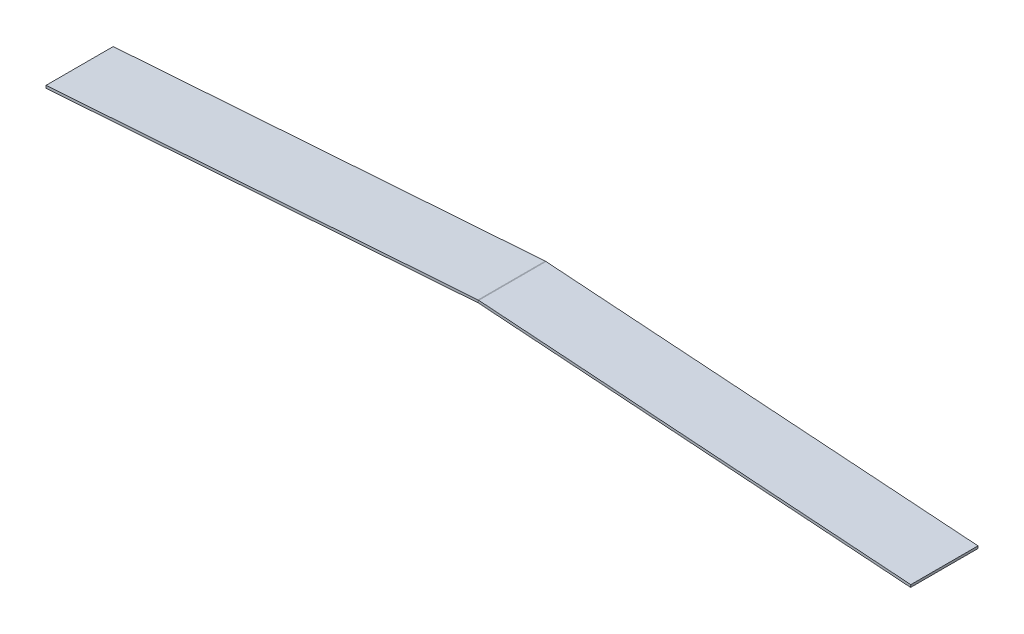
ISO-10303-21;
HEADER;
FILE_DESCRIPTION(('STEP AP214'),'2;1');
FILE_NAME('part.step','',(''),(''),'','','');
FILE_SCHEMA(('AUTOMOTIVE_DESIGN { 1 0 10303 214 1 1 1 1 }'));
ENDSEC;
DATA;
#1=APPLICATION_CONTEXT('core data for automotive mechanical design processes');
#2=APPLICATION_PROTOCOL_DEFINITION('international standard','automotive_design',2000,#1);
#3=PRODUCT_CONTEXT('',#1,'mechanical');
#4=PRODUCT('Part','Part','',(#3));
#5=PRODUCT_RELATED_PRODUCT_CATEGORY('part','',(#4));
#6=PRODUCT_DEFINITION_FORMATION('','',#4);
#7=PRODUCT_DEFINITION_CONTEXT('part definition',#1,'design');
#8=PRODUCT_DEFINITION('design','',#6,#7);
#9=PRODUCT_DEFINITION_SHAPE('','',#8);
#10=(LENGTH_UNIT() NAMED_UNIT(*) SI_UNIT(.MILLI.,.METRE.));
#11=(NAMED_UNIT(*) PLANE_ANGLE_UNIT() SI_UNIT($,.RADIAN.));
#12=(NAMED_UNIT(*) SI_UNIT($,.STERADIAN.) SOLID_ANGLE_UNIT());
#13=UNCERTAINTY_MEASURE_WITH_UNIT(LENGTH_MEASURE(1.E-05),#10,'distance_accuracy_value','');
#14=(GEOMETRIC_REPRESENTATION_CONTEXT(3) GLOBAL_UNCERTAINTY_ASSIGNED_CONTEXT((#13)) GLOBAL_UNIT_ASSIGNED_CONTEXT((#10,
#11,#12)) REPRESENTATION_CONTEXT('',''));
#15=CARTESIAN_POINT('',(0.,0.,0.));
#16=DIRECTION('',(0.,0.,1.));
#17=DIRECTION('',(1.,0.,0.));
#18=AXIS2_PLACEMENT_3D('',#15,#16,#17);
#19=CARTESIAN_POINT('',(0.885907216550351,-0.0619486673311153,168.275));
#20=DIRECTION('',(0.,0.,1.));
#21=DIRECTION('',(1.,0.,0.));
#22=AXIS2_PLACEMENT_3D('',#19,#20,#21);
#23=PLANE('',#22);
#24=DIRECTION('',(-0.0697564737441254,-0.997564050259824,0.));
#25=VECTOR('',#24,1.);
#26=CARTESIAN_POINT('',(0.885907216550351,-0.0619486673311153,168.275));
#27=LINE('',#26,#25);
#28=CARTESIAN_POINT('',(0.885907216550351,-0.0619486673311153,168.275));
#29=VERTEX_POINT('',#28);
#30=CARTESIAN_POINT('',(0.442953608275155,-6.396480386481,168.275));
#31=VERTEX_POINT('',#30);
#32=EDGE_CURVE('E11',#29,#31,#27,.T.);
#33=ORIENTED_EDGE('',*,*,#32,.F.);
#34=CARTESIAN_POINT('',(0.,-12.7310121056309,168.275));
#35=DIRECTION('',(0.,0.,1.));
#36=DIRECTION('',(1.,0.,0.));
#37=AXIS2_PLACEMENT_3D('',#34,#35,#36);
#38=CIRCLE('',#37,12.7);
#39=CARTESIAN_POINT('',(-0.885907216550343,-0.0619486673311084,168.275));
#40=VERTEX_POINT('',#39);
#41=EDGE_CURVE('E134',#40,#29,#38,.F.);
#42=ORIENTED_EDGE('',*,*,#41,.F.);
#43=DIRECTION('',(-0.0697564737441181,0.997564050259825,0.));
#44=VECTOR('',#43,1.);
#45=CARTESIAN_POINT('',(-0.442953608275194,-6.396480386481,168.275));
#46=LINE('',#45,#44);
#47=CARTESIAN_POINT('',(-0.442953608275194,-6.396480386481,168.275));
#48=VERTEX_POINT('',#47);
#49=EDGE_CURVE('E45',#48,#40,#46,.T.);
#50=ORIENTED_EDGE('',*,*,#49,.F.);
#51=CARTESIAN_POINT('',(0.,-12.7310121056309,168.275));
#52=DIRECTION('',(0.,0.,-1.));
#53=DIRECTION('',(1.,0.,0.));
#54=AXIS2_PLACEMENT_3D('',#51,#52,#53);
#55=CIRCLE('',#54,6.35);
#56=EDGE_CURVE('E186',#48,#31,#55,.T.);
#57=ORIENTED_EDGE('',*,*,#56,.T.);
#58=EDGE_LOOP('',(#33,#42,#50,#57));
#59=FACE_BOUND('',#58,.T.);
#60=ADVANCED_FACE('F37',(#59),#23,.T.);
#61=CARTESIAN_POINT('',(-0.442953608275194,-6.396480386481,168.275));
#62=DIRECTION('',(0.,0.,1.));
#63=DIRECTION('',(1.,0.,0.));
#64=AXIS2_PLACEMENT_3D('',#61,#62,#63);
#65=PLANE('',#64);
#66=DIRECTION('',(0.997564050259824,-0.0697564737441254,0.));
#67=VECTOR('',#66,1.);
#68=CARTESIAN_POINT('',(0.,0.,168.275));
#69=LINE('',#68,#67);
#70=CARTESIAN_POINT('',(1082.675,-75.7080111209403,168.275));
#71=VERTEX_POINT('',#70);
#72=EDGE_CURVE('E159',#29,#71,#69,.T.);
#73=ORIENTED_EDGE('',*,*,#72,.F.);
#74=ORIENTED_EDGE('',*,*,#32,.T.);
#75=DIRECTION('',(0.997564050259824,-0.0697564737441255,0.));
#76=VECTOR('',#75,1.);
#77=CARTESIAN_POINT('',(-0.442953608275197,-6.33453171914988,168.275));
#78=LINE('',#77,#76);
#79=CARTESIAN_POINT('',(1082.23204639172,-82.0425428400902,168.275));
#80=VERTEX_POINT('',#79);
#81=EDGE_CURVE('E202',#31,#80,#78,.T.);
#82=ORIENTED_EDGE('',*,*,#81,.T.);
#83=DIRECTION('',(0.0697564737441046,0.997564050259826,0.));
#84=VECTOR('',#83,1.);
#85=CARTESIAN_POINT('',(1082.23204639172,-82.0425428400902,168.275));
#86=LINE('',#85,#84);
#87=EDGE_CURVE('E96',#80,#71,#86,.T.);
#88=ORIENTED_EDGE('',*,*,#87,.T.);
#89=EDGE_LOOP('',(#73,#74,#82,#88));
#90=FACE_BOUND('',#89,.T.);
#91=ADVANCED_FACE('F207',(#90),#65,.T.);
#92=CARTESIAN_POINT('',(-0.885907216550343,-0.0619486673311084,0.));
#93=DIRECTION('',(0.,0.,-1.));
#94=DIRECTION('',(-1.,0.,0.));
#95=AXIS2_PLACEMENT_3D('',#92,#93,#94);
#96=PLANE('',#95);
#97=DIRECTION('',(0.0697564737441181,-0.997564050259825,0.));
#98=VECTOR('',#97,1.);
#99=CARTESIAN_POINT('',(-0.885907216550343,-0.0619486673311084,0.));
#100=LINE('',#99,#98);
#101=CARTESIAN_POINT('',(-0.885907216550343,-0.0619486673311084,0.));
#102=VERTEX_POINT('',#101);
#103=CARTESIAN_POINT('',(-0.442953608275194,-6.396480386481,0.));
#104=VERTEX_POINT('',#103);
#105=EDGE_CURVE('E80',#102,#104,#100,.T.);
#106=ORIENTED_EDGE('',*,*,#105,.F.);
#107=CARTESIAN_POINT('',(0.,-12.7310121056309,0.));
#108=DIRECTION('',(0.,0.,1.));
#109=DIRECTION('',(1.,0.,0.));
#110=AXIS2_PLACEMENT_3D('',#107,#108,#109);
#111=CIRCLE('',#110,12.7);
#112=CARTESIAN_POINT('',(0.885907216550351,-0.0619486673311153,0.));
#113=VERTEX_POINT('',#112);
#114=EDGE_CURVE('E157',#102,#113,#111,.F.);
#115=ORIENTED_EDGE('',*,*,#114,.T.);
#116=DIRECTION('',(0.0697564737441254,0.997564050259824,0.));
#117=VECTOR('',#116,1.);
#118=CARTESIAN_POINT('',(0.442953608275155,-6.396480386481,0.));
#119=LINE('',#118,#117);
#120=CARTESIAN_POINT('',(0.442953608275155,-6.396480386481,0.));
#121=VERTEX_POINT('',#120);
#122=EDGE_CURVE('E87',#121,#113,#119,.T.);
#123=ORIENTED_EDGE('',*,*,#122,.F.);
#124=CARTESIAN_POINT('',(0.,-12.7310121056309,0.));
#125=DIRECTION('',(0.,0.,-1.));
#126=DIRECTION('',(1.,0.,0.));
#127=AXIS2_PLACEMENT_3D('',#124,#125,#126);
#128=CIRCLE('',#127,6.35);
#129=EDGE_CURVE('E148',#104,#121,#128,.T.);
#130=ORIENTED_EDGE('',*,*,#129,.F.);
#131=EDGE_LOOP('',(#106,#115,#123,#130));
#132=FACE_BOUND('',#131,.T.);
#133=ADVANCED_FACE('F187',(#132),#96,.T.);
#134=CARTESIAN_POINT('',(0.442953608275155,-6.396480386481,0.));
#135=DIRECTION('',(0.,0.,-1.));
#136=DIRECTION('',(-1.,0.,0.));
#137=AXIS2_PLACEMENT_3D('',#134,#135,#136);
#138=PLANE('',#137);
#139=DIRECTION('',(0.997564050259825,0.0697564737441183,0.));
#140=VECTOR('',#139,1.);
#141=CARTESIAN_POINT('',(0.,0.,0.));
#142=LINE('',#141,#140);
#143=CARTESIAN_POINT('',(-1082.675,-75.7080111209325,0.));
#144=VERTEX_POINT('',#143);
#145=EDGE_CURVE('E117',#144,#102,#142,.T.);
#146=ORIENTED_EDGE('',*,*,#145,.T.);
#147=ORIENTED_EDGE('',*,*,#105,.T.);
#148=DIRECTION('',(0.997564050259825,0.0697564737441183,0.));
#149=VECTOR('',#148,1.);
#150=CARTESIAN_POINT('',(0.442953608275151,-6.33453171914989,0.));
#151=LINE('',#150,#149);
#152=CARTESIAN_POINT('',(-1082.23204639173,-82.0425428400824,0.));
#153=VERTEX_POINT('',#152);
#154=EDGE_CURVE('E151',#153,#104,#151,.T.);
#155=ORIENTED_EDGE('',*,*,#154,.F.);
#156=DIRECTION('',(0.0697564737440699,-0.997564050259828,0.));
#157=VECTOR('',#156,1.);
#158=CARTESIAN_POINT('',(-1082.675,-75.7080111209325,0.));
#159=LINE('',#158,#157);
#160=EDGE_CURVE('E154',#144,#153,#159,.T.);
#161=ORIENTED_EDGE('',*,*,#160,.F.);
#162=EDGE_LOOP('',(#146,#147,#155,#161));
#163=FACE_BOUND('',#162,.T.);
#164=ADVANCED_FACE('F177',(#163),#138,.T.);
#165=CARTESIAN_POINT('',(0.,0.,168.275));
#166=DIRECTION('',(0.0697564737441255,0.997564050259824,0.));
#167=DIRECTION('',(-0.997564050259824,0.0697564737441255,0.));
#168=AXIS2_PLACEMENT_3D('',#165,#166,#167);
#169=PLANE('',#168);
#170=DIRECTION('',(0.997564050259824,-0.0697564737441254,0.));
#171=VECTOR('',#170,1.);
#172=CARTESIAN_POINT('',(0.,0.,0.));
#173=LINE('',#172,#171);
#174=CARTESIAN_POINT('',(1082.675,-75.7080111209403,0.));
#175=VERTEX_POINT('',#174);
#176=EDGE_CURVE('E141',#113,#175,#173,.T.);
#177=ORIENTED_EDGE('',*,*,#176,.F.);
#178=DIRECTION('',(0.,0.,-1.));
#179=VECTOR('',#178,1.);
#180=CARTESIAN_POINT('',(0.885907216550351,-0.0619486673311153,168.275));
#181=LINE('',#180,#179);
#182=EDGE_CURVE('E160',#29,#113,#181,.T.);
#183=ORIENTED_EDGE('',*,*,#182,.F.);
#184=ORIENTED_EDGE('',*,*,#72,.T.);
#185=DIRECTION('',(0.,0.,-1.));
#186=VECTOR('',#185,1.);
#187=CARTESIAN_POINT('',(1082.675,-75.7080111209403,168.275));
#188=LINE('',#187,#186);
#189=EDGE_CURVE('E137',#71,#175,#188,.T.);
#190=ORIENTED_EDGE('',*,*,#189,.T.);
#191=EDGE_LOOP('',(#177,#183,#184,#190));
#192=FACE_BOUND('',#191,.T.);
#193=ADVANCED_FACE('F193',(#192),#169,.T.);
#194=CARTESIAN_POINT('',(0.,-12.7310121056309,168.275));
#195=DIRECTION('',(0.,0.,-1.));
#196=DIRECTION('',(-1.,0.,0.));
#197=AXIS2_PLACEMENT_3D('',#194,#195,#196);
#198=CYLINDRICAL_SURFACE('',#197,12.7);
#199=ORIENTED_EDGE('',*,*,#114,.F.);
#200=DIRECTION('',(0.,0.,-1.));
#201=VECTOR('',#200,1.);
#202=CARTESIAN_POINT('',(-0.885907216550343,-0.0619486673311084,168.275));
#203=LINE('',#202,#201);
#204=EDGE_CURVE('E120',#40,#102,#203,.T.);
#205=ORIENTED_EDGE('',*,*,#204,.F.);
#206=ORIENTED_EDGE('',*,*,#41,.T.);
#207=ORIENTED_EDGE('',*,*,#182,.T.);
#208=EDGE_LOOP('',(#199,#205,#206,#207));
#209=FACE_BOUND('',#208,.T.);
#210=ADVANCED_FACE('F189',(#209),#198,.T.);
#211=CARTESIAN_POINT('',(0.,0.,168.275));
#212=DIRECTION('',(-0.0697564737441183,0.997564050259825,0.));
#213=DIRECTION('',(-0.997564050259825,-0.0697564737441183,0.));
#214=AXIS2_PLACEMENT_3D('',#211,#212,#213);
#215=PLANE('',#214);
#216=ORIENTED_EDGE('',*,*,#145,.F.);
#217=DIRECTION('',(0.,0.,-1.));
#218=VECTOR('',#217,1.);
#219=CARTESIAN_POINT('',(-1082.675,-75.7080111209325,168.275));
#220=LINE('',#219,#218);
#221=CARTESIAN_POINT('',(-1082.675,-75.7080111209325,168.275));
#222=VERTEX_POINT('',#221);
#223=EDGE_CURVE('E111',#222,#144,#220,.T.);
#224=ORIENTED_EDGE('',*,*,#223,.F.);
#225=DIRECTION('',(0.997564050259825,0.0697564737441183,0.));
#226=VECTOR('',#225,1.);
#227=CARTESIAN_POINT('',(0.,0.,168.275));
#228=LINE('',#227,#226);
#229=EDGE_CURVE('E115',#222,#40,#228,.T.);
#230=ORIENTED_EDGE('',*,*,#229,.T.);
#231=ORIENTED_EDGE('',*,*,#204,.T.);
#232=EDGE_LOOP('',(#216,#224,#230,#231));
#233=FACE_BOUND('',#232,.T.);
#234=ADVANCED_FACE('F113',(#233),#215,.T.);
#235=CARTESIAN_POINT('',(-1082.675,-75.7080111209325,168.275));
#236=DIRECTION('',(0.997564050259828,0.0697564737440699,0.));
#237=DIRECTION('',(-0.0697564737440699,0.997564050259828,0.));
#238=AXIS2_PLACEMENT_3D('',#235,#236,#237);
#239=PLANE('',#238);
#240=ORIENTED_EDGE('',*,*,#160,.T.);
#241=DIRECTION('',(0.,0.,-1.));
#242=VECTOR('',#241,1.);
#243=CARTESIAN_POINT('',(-1082.23204639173,-82.0425428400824,168.275));
#244=LINE('',#243,#242);
#245=CARTESIAN_POINT('',(-1082.23204639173,-82.0425428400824,168.275));
#246=VERTEX_POINT('',#245);
#247=EDGE_CURVE('E121',#246,#153,#244,.T.);
#248=ORIENTED_EDGE('',*,*,#247,.F.);
#249=DIRECTION('',(0.0697564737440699,-0.997564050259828,0.));
#250=VECTOR('',#249,1.);
#251=CARTESIAN_POINT('',(-1082.675,-75.7080111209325,168.275));
#252=LINE('',#251,#250);
#253=EDGE_CURVE('E124',#222,#246,#252,.T.);
#254=ORIENTED_EDGE('',*,*,#253,.F.);
#255=ORIENTED_EDGE('',*,*,#223,.T.);
#256=EDGE_LOOP('',(#240,#248,#254,#255));
#257=FACE_BOUND('',#256,.T.);
#258=ADVANCED_FACE('F125',(#257),#239,.F.);
#259=CARTESIAN_POINT('',(0.442953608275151,-6.33453171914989,168.275));
#260=DIRECTION('',(-0.0697564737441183,0.997564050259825,0.));
#261=DIRECTION('',(-0.997564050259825,-0.0697564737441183,0.));
#262=AXIS2_PLACEMENT_3D('',#259,#260,#261);
#263=PLANE('',#262);
#264=ORIENTED_EDGE('',*,*,#154,.T.);
#265=DIRECTION('',(0.,0.,-1.));
#266=VECTOR('',#265,1.);
#267=CARTESIAN_POINT('',(-0.442953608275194,-6.396480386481,168.275));
#268=LINE('',#267,#266);
#269=EDGE_CURVE('E164',#48,#104,#268,.T.);
#270=ORIENTED_EDGE('',*,*,#269,.F.);
#271=DIRECTION('',(0.997564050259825,0.0697564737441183,0.));
#272=VECTOR('',#271,1.);
#273=CARTESIAN_POINT('',(0.442953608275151,-6.33453171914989,168.275));
#274=LINE('',#273,#272);
#275=EDGE_CURVE('E130',#246,#48,#274,.T.);
#276=ORIENTED_EDGE('',*,*,#275,.F.);
#277=ORIENTED_EDGE('',*,*,#247,.T.);
#278=EDGE_LOOP('',(#264,#270,#276,#277));
#279=FACE_BOUND('',#278,.T.);
#280=ADVANCED_FACE('F181',(#279),#263,.F.);
#281=CARTESIAN_POINT('',(0.,-12.7310121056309,168.275));
#282=DIRECTION('',(0.,0.,-1.));
#283=DIRECTION('',(-1.,0.,0.));
#284=AXIS2_PLACEMENT_3D('',#281,#282,#283);
#285=CYLINDRICAL_SURFACE('',#284,6.35);
#286=ORIENTED_EDGE('',*,*,#129,.T.);
#287=DIRECTION('',(0.,0.,-1.));
#288=VECTOR('',#287,1.);
#289=CARTESIAN_POINT('',(0.442953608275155,-6.396480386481,168.275));
#290=LINE('',#289,#288);
#291=EDGE_CURVE('E167',#31,#121,#290,.T.);
#292=ORIENTED_EDGE('',*,*,#291,.F.);
#293=ORIENTED_EDGE('',*,*,#56,.F.);
#294=ORIENTED_EDGE('',*,*,#269,.T.);
#295=EDGE_LOOP('',(#286,#292,#293,#294));
#296=FACE_BOUND('',#295,.T.);
#297=ADVANCED_FACE('F184',(#296),#285,.F.);
#298=CARTESIAN_POINT('',(-0.442953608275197,-6.33453171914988,168.275));
#299=DIRECTION('',(0.0697564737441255,0.997564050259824,0.));
#300=DIRECTION('',(-0.997564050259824,0.0697564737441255,0.));
#301=AXIS2_PLACEMENT_3D('',#298,#299,#300);
#302=PLANE('',#301);
#303=DIRECTION('',(0.997564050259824,-0.0697564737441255,0.));
#304=VECTOR('',#303,1.);
#305=CARTESIAN_POINT('',(-0.442953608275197,-6.33453171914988,0.));
#306=LINE('',#305,#304);
#307=CARTESIAN_POINT('',(1082.23204639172,-82.0425428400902,0.));
#308=VERTEX_POINT('',#307);
#309=EDGE_CURVE('E146',#121,#308,#306,.T.);
#310=ORIENTED_EDGE('',*,*,#309,.T.);
#311=DIRECTION('',(0.,0.,-1.));
#312=VECTOR('',#311,1.);
#313=CARTESIAN_POINT('',(1082.23204639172,-82.0425428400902,168.275));
#314=LINE('',#313,#312);
#315=EDGE_CURVE('E170',#80,#308,#314,.T.);
#316=ORIENTED_EDGE('',*,*,#315,.F.);
#317=ORIENTED_EDGE('',*,*,#81,.F.);
#318=ORIENTED_EDGE('',*,*,#291,.T.);
#319=EDGE_LOOP('',(#310,#316,#317,#318));
#320=FACE_BOUND('',#319,.T.);
#321=ADVANCED_FACE('F201',(#320),#302,.F.);
#322=CARTESIAN_POINT('',(1082.23204639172,-82.0425428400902,168.275));
#323=DIRECTION('',(-0.997564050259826,0.0697564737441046,0.));
#324=DIRECTION('',(-0.0697564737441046,-0.997564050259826,0.));
#325=AXIS2_PLACEMENT_3D('',#322,#323,#324);
#326=PLANE('',#325);
#327=DIRECTION('',(0.0697564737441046,0.997564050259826,0.));
#328=VECTOR('',#327,1.);
#329=CARTESIAN_POINT('',(1082.23204639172,-82.0425428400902,0.));
#330=LINE('',#329,#328);
#331=EDGE_CURVE('E143',#308,#175,#330,.T.);
#332=ORIENTED_EDGE('',*,*,#331,.T.);
#333=ORIENTED_EDGE('',*,*,#189,.F.);
#334=ORIENTED_EDGE('',*,*,#87,.F.);
#335=ORIENTED_EDGE('',*,*,#315,.T.);
#336=EDGE_LOOP('',(#332,#333,#334,#335));
#337=FACE_BOUND('',#336,.T.);
#338=ADVANCED_FACE('F197',(#337),#326,.F.);
#339=CARTESIAN_POINT('',(0.,-12.7310121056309,168.275));
#340=DIRECTION('',(0.,0.,-1.));
#341=DIRECTION('',(1.,0.,0.));
#342=AXIS2_PLACEMENT_3D('',#339,#340,#341);
#343=PLANE('',#342);
#344=ORIENTED_EDGE('',*,*,#275,.T.);
#345=ORIENTED_EDGE('',*,*,#49,.T.);
#346=ORIENTED_EDGE('',*,*,#229,.F.);
#347=ORIENTED_EDGE('',*,*,#253,.T.);
#348=EDGE_LOOP('',(#344,#345,#346,#347));
#349=FACE_BOUND('',#348,.T.);
#350=ADVANCED_FACE('F132',(#349),#343,.F.);
#351=CARTESIAN_POINT('',(0.,-12.7310121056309,0.));
#352=DIRECTION('',(0.,0.,-1.));
#353=DIRECTION('',(1.,0.,0.));
#354=AXIS2_PLACEMENT_3D('',#351,#352,#353);
#355=PLANE('',#354);
#356=ORIENTED_EDGE('',*,*,#176,.T.);
#357=ORIENTED_EDGE('',*,*,#331,.F.);
#358=ORIENTED_EDGE('',*,*,#309,.F.);
#359=ORIENTED_EDGE('',*,*,#122,.T.);
#360=EDGE_LOOP('',(#356,#357,#358,#359));
#361=FACE_BOUND('',#360,.T.);
#362=ADVANCED_FACE('F195',(#361),#355,.T.);
#363=CLOSED_SHELL('',(#60,#91,#133,#164,#193,#210,#234,#258,#280,#297,#321,#338,#350,#362));
#364=MANIFOLD_SOLID_BREP('B2',#363);
#365=ADVANCED_BREP_SHAPE_REPRESENTATION('',(#18,#364),#14);
#366=SHAPE_DEFINITION_REPRESENTATION(#9,#365);
ENDSEC;
END-ISO-10303-21;
